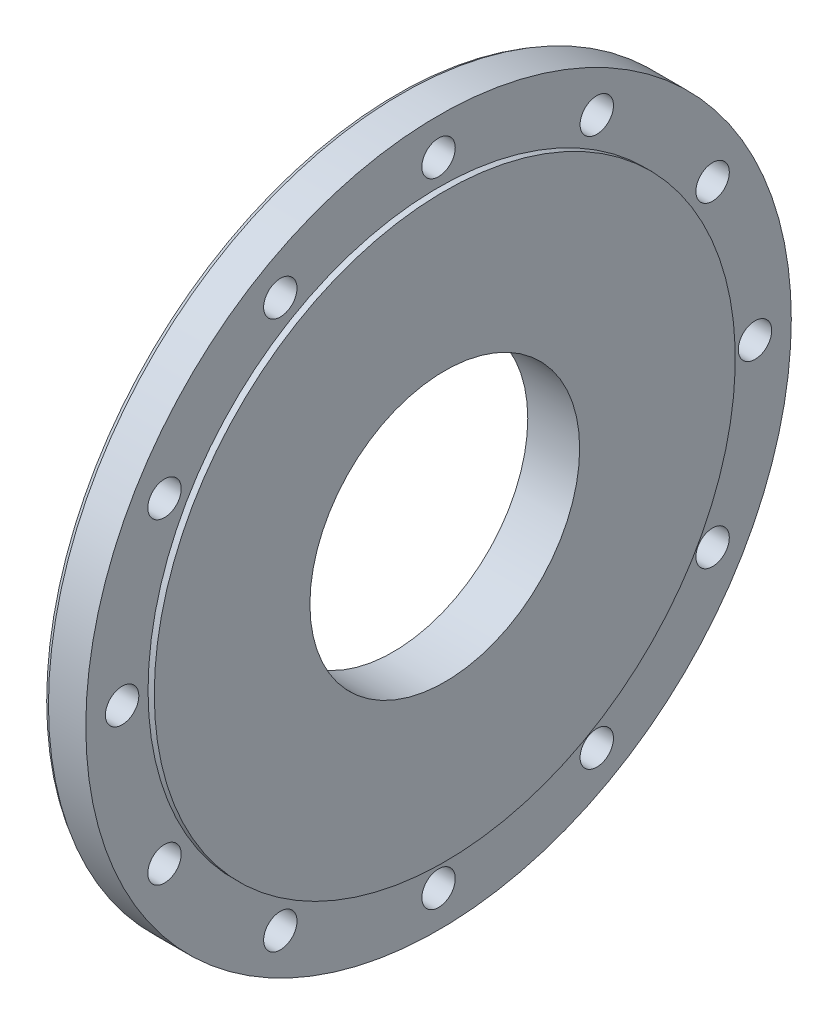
from build123d import *

# Parameters (mm, degrees)
CHANFREIN1_SIZE         = 2
CHANFREIN1_SIZE2        = 1.154700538
ESQUISSE2_R             = 8.05
ENL_V_MAT_EXTRU_1_DEPTH = 242.420794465


with BuildPart() as part:
    # Esquisse1 → R_volution1 (revolve)
    with BuildSketch(Plane.XY, mode=Mode.PRIVATE) as r_volution1_sk:
        Polygon((0, 65), (0, 130), (2, 130), (2, 170), (22, 170), (22, 140), (25, 140), (25, 65), align=None)
    revolve(r_volution1_sk.sketch.rotate(Axis((0, 0, 0), (1, 0, 0)), 90), axis=Axis((0, 0, 0), (1, 0, 0)))

    # Chanfrein1
    chanfrein1_edges = [part.edges().sort_by_distance(p)[0] for p in [
        (2, 0, -170),
    ]]
    chanfrein1_side = [part.faces().sort_by_distance(p)[0] for p in [
        (12, 0, -170),
    ]]
    chamfer(chanfrein1_edges, length=CHANFREIN1_SIZE, length2=CHANFREIN1_SIZE2, reference=chanfrein1_side[0])

    # Esquisse2 → Enl_v. mat.-Extru.1 (cut, through all)
    with BuildSketch(Plane(origin=(22, 0, 0), x_dir=(0, 0, -1), z_dir=(1, 0, 0))):
        with Locations((0, 152.5)):
            Circle(ESQUISSE2_R)
        with Locations((76.25, 132.068874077)):
            Circle(ESQUISSE2_R)
        with Locations((132.068874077, 76.25)):
            Circle(ESQUISSE2_R)
        with Locations((152.5, 0)):
            Circle(ESQUISSE2_R)
        with Locations((132.068874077, -76.25)):
            Circle(ESQUISSE2_R)
        with Locations((76.25, -132.068874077)):
            Circle(ESQUISSE2_R)
        with Locations((0, -152.5)):
            Circle(ESQUISSE2_R)
        with Locations((-76.25, -132.068874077)):
            Circle(ESQUISSE2_R)
        with Locations((-132.068874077, -76.25)):
            Circle(ESQUISSE2_R)
        with Locations((-152.5, 0)):
            Circle(ESQUISSE2_R)
        with Locations((-132.068874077, 76.25)):
            Circle(ESQUISSE2_R)
        with Locations((-76.25, 132.068874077)):
            Circle(ESQUISSE2_R)
    extrude(amount=-ENL_V_MAT_EXTRU_1_DEPTH, mode=Mode.SUBTRACT)


solid = part.part
